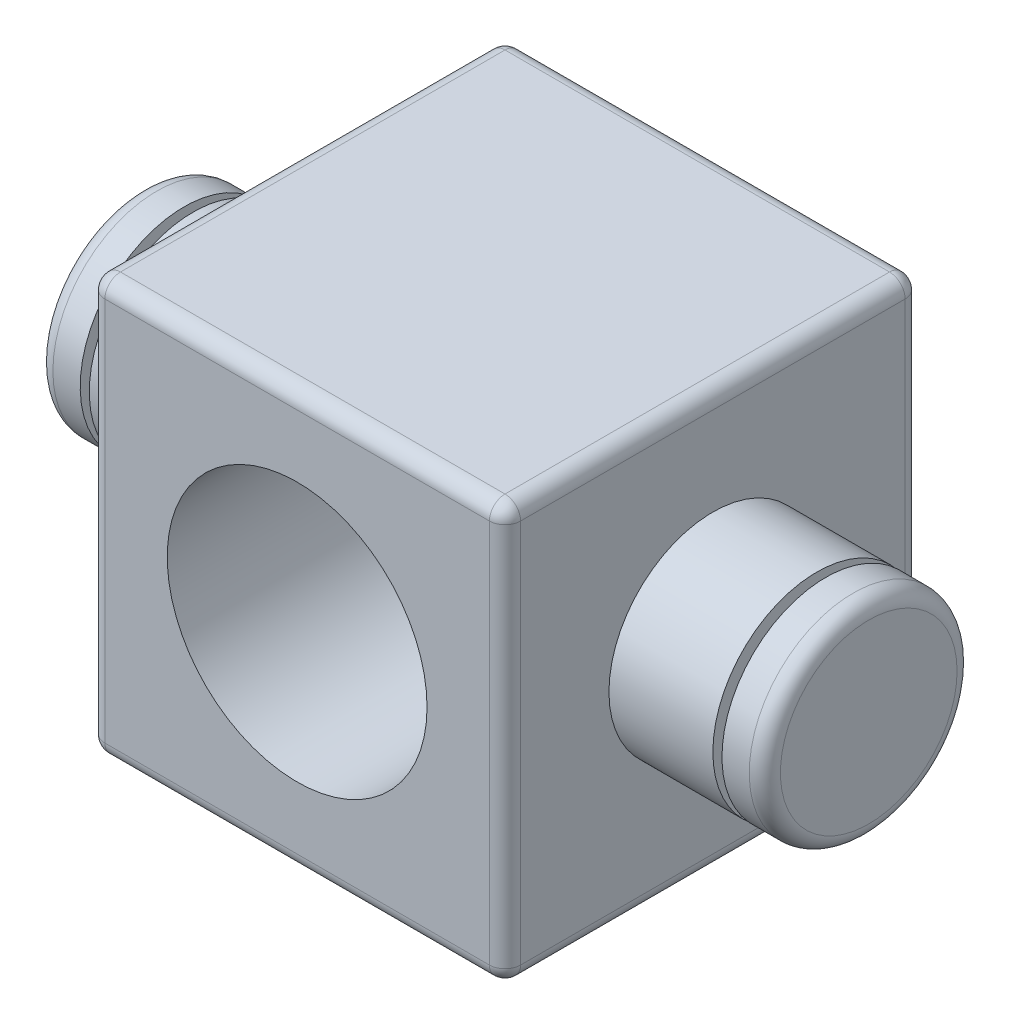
ISO-10303-21;
HEADER;
FILE_DESCRIPTION(('STEP AP214'),'2;1');
FILE_NAME('part.step','',(''),(''),'','','');
FILE_SCHEMA(('AUTOMOTIVE_DESIGN { 1 0 10303 214 1 1 1 1 }'));
ENDSEC;
DATA;
#1=APPLICATION_CONTEXT('core data for automotive mechanical design processes');
#2=APPLICATION_PROTOCOL_DEFINITION('international standard','automotive_design',2000,#1);
#3=PRODUCT_CONTEXT('',#1,'mechanical');
#4=PRODUCT('Part','Part','',(#3));
#5=PRODUCT_RELATED_PRODUCT_CATEGORY('part','',(#4));
#6=PRODUCT_DEFINITION_FORMATION('','',#4);
#7=PRODUCT_DEFINITION_CONTEXT('part definition',#1,'design');
#8=PRODUCT_DEFINITION('design','',#6,#7);
#9=PRODUCT_DEFINITION_SHAPE('','',#8);
#10=(LENGTH_UNIT() NAMED_UNIT(*) SI_UNIT(.MILLI.,.METRE.));
#11=(NAMED_UNIT(*) PLANE_ANGLE_UNIT() SI_UNIT($,.RADIAN.));
#12=(NAMED_UNIT(*) SI_UNIT($,.STERADIAN.) SOLID_ANGLE_UNIT());
#13=UNCERTAINTY_MEASURE_WITH_UNIT(LENGTH_MEASURE(1.E-05),#10,'distance_accuracy_value','');
#14=(GEOMETRIC_REPRESENTATION_CONTEXT(3) GLOBAL_UNCERTAINTY_ASSIGNED_CONTEXT((#13)) GLOBAL_UNIT_ASSIGNED_CONTEXT((#10,
#11,#12)) REPRESENTATION_CONTEXT('',''));
#15=CARTESIAN_POINT('',(0.,0.,0.));
#16=DIRECTION('',(0.,0.,1.));
#17=DIRECTION('',(1.,0.,0.));
#18=AXIS2_PLACEMENT_3D('',#15,#16,#17);
#19=CARTESIAN_POINT('',(110.,40.,40.));
#20=DIRECTION('',(-1.,0.,0.));
#21=DIRECTION('',(0.,0.,1.));
#22=AXIS2_PLACEMENT_3D('',#19,#20,#21);
#23=CYLINDRICAL_SURFACE('',#22,20.);
#24=CARTESIAN_POINT('',(80.,40.,40.));
#25=DIRECTION('',(-1.,0.,0.));
#26=DIRECTION('',(0.,0.,1.));
#27=AXIS2_PLACEMENT_3D('',#24,#25,#26);
#28=CIRCLE('',#27,20.);
#29=CARTESIAN_POINT('',(80.,40.,60.));
#30=VERTEX_POINT('',#29);
#31=EDGE_CURVE('E277',#30,#30,#28,.F.);
#32=ORIENTED_EDGE('',*,*,#31,.T.);
#33=EDGE_LOOP('',(#32));
#34=FACE_BOUND('',#33,.T.);
#35=CARTESIAN_POINT('',(100.,40.,40.));
#36=DIRECTION('',(-1.,0.,0.));
#37=DIRECTION('',(0.,-1.,0.));
#38=AXIS2_PLACEMENT_3D('',#35,#36,#37);
#39=CIRCLE('',#38,20.);
#40=CARTESIAN_POINT('',(100.,20.,40.));
#41=VERTEX_POINT('',#40);
#42=EDGE_CURVE('E343',#41,#41,#39,.T.);
#43=ORIENTED_EDGE('',*,*,#42,.T.);
#44=EDGE_LOOP('',(#43));
#45=FACE_BOUND('',#44,.T.);
#46=ADVANCED_FACE('F34',(#34,#45),#23,.T.);
#47=CARTESIAN_POINT('',(-30.,40.,40.));
#48=DIRECTION('',(1.,0.,0.));
#49=DIRECTION('',(0.,0.,-1.));
#50=AXIS2_PLACEMENT_3D('',#47,#48,#49);
#51=CYLINDRICAL_SURFACE('',#50,20.);
#52=CARTESIAN_POINT('',(0.,40.,40.));
#53=DIRECTION('',(1.,0.,0.));
#54=DIRECTION('',(0.,0.,-1.));
#55=AXIS2_PLACEMENT_3D('',#52,#53,#54);
#56=CIRCLE('',#55,20.);
#57=CARTESIAN_POINT('',(0.,40.,20.));
#58=VERTEX_POINT('',#57);
#59=EDGE_CURVE('E283',#58,#58,#56,.F.);
#60=ORIENTED_EDGE('',*,*,#59,.T.);
#61=EDGE_LOOP('',(#60));
#62=FACE_BOUND('',#61,.T.);
#63=CARTESIAN_POINT('',(-20.,40.,40.));
#64=DIRECTION('',(-1.,0.,0.));
#65=DIRECTION('',(0.,-1.,0.));
#66=AXIS2_PLACEMENT_3D('',#63,#64,#65);
#67=CIRCLE('',#66,20.);
#68=CARTESIAN_POINT('',(-20.,20.,40.));
#69=VERTEX_POINT('',#68);
#70=EDGE_CURVE('E356',#69,#69,#67,.T.);
#71=ORIENTED_EDGE('',*,*,#70,.F.);
#72=EDGE_LOOP('',(#71));
#73=FACE_BOUND('',#72,.T.);
#74=ADVANCED_FACE('F315',(#62,#73),#51,.T.);
#75=CARTESIAN_POINT('',(0.,0.,80.));
#76=DIRECTION('',(0.,0.,-1.));
#77=DIRECTION('',(-1.,0.,0.));
#78=AXIS2_PLACEMENT_3D('',#75,#76,#77);
#79=PLANE('',#78);
#80=DIRECTION('',(0.,-1.,0.));
#81=VECTOR('',#80,1.);
#82=CARTESIAN_POINT('',(3.,0.,80.));
#83=LINE('',#82,#81);
#84=CARTESIAN_POINT('',(3.,77.,80.));
#85=VERTEX_POINT('',#84);
#86=CARTESIAN_POINT('',(3.,3.,80.));
#87=VERTEX_POINT('',#86);
#88=EDGE_CURVE('E191',#85,#87,#83,.T.);
#89=ORIENTED_EDGE('',*,*,#88,.T.);
#90=DIRECTION('',(1.,0.,0.));
#91=VECTOR('',#90,1.);
#92=CARTESIAN_POINT('',(0.,3.,80.));
#93=LINE('',#92,#91);
#94=CARTESIAN_POINT('',(77.,3.,80.));
#95=VERTEX_POINT('',#94);
#96=EDGE_CURVE('E193',#87,#95,#93,.T.);
#97=ORIENTED_EDGE('',*,*,#96,.T.);
#98=DIRECTION('',(0.,1.,0.));
#99=VECTOR('',#98,1.);
#100=CARTESIAN_POINT('',(77.,0.,80.));
#101=LINE('',#100,#99);
#102=CARTESIAN_POINT('',(77.,77.,80.));
#103=VERTEX_POINT('',#102);
#104=EDGE_CURVE('E187',#95,#103,#101,.T.);
#105=ORIENTED_EDGE('',*,*,#104,.T.);
#106=DIRECTION('',(-1.,0.,0.));
#107=VECTOR('',#106,1.);
#108=CARTESIAN_POINT('',(0.,77.,80.));
#109=LINE('',#108,#107);
#110=EDGE_CURVE('E189',#103,#85,#109,.T.);
#111=ORIENTED_EDGE('',*,*,#110,.T.);
#112=EDGE_LOOP('',(#89,#97,#105,#111));
#113=FACE_BOUND('',#112,.T.);
#114=CARTESIAN_POINT('',(40.,40.,80.));
#115=DIRECTION('',(0.,0.,1.));
#116=DIRECTION('',(1.,0.,0.));
#117=AXIS2_PLACEMENT_3D('',#114,#115,#116);
#118=CIRCLE('',#117,25.);
#119=CARTESIAN_POINT('',(65.,40.,80.));
#120=VERTEX_POINT('',#119);
#121=EDGE_CURVE('E272',#120,#120,#118,.T.);
#122=ORIENTED_EDGE('',*,*,#121,.F.);
#123=EDGE_LOOP('',(#122));
#124=FACE_BOUND('',#123,.T.);
#125=ADVANCED_FACE('F323',(#113,#124),#79,.F.);
#126=CARTESIAN_POINT('',(0.,0.,0.));
#127=DIRECTION('',(0.,0.,-1.));
#128=DIRECTION('',(-1.,0.,0.));
#129=AXIS2_PLACEMENT_3D('',#126,#127,#128);
#130=PLANE('',#129);
#131=DIRECTION('',(1.,0.,0.));
#132=VECTOR('',#131,1.);
#133=CARTESIAN_POINT('',(0.,3.,0.));
#134=LINE('',#133,#132);
#135=CARTESIAN_POINT('',(77.,3.,0.));
#136=VERTEX_POINT('',#135);
#137=CARTESIAN_POINT('',(3.,3.,0.));
#138=VERTEX_POINT('',#137);
#139=EDGE_CURVE('E43',#136,#138,#134,.F.);
#140=ORIENTED_EDGE('',*,*,#139,.T.);
#141=DIRECTION('',(0.,-1.,0.));
#142=VECTOR('',#141,1.);
#143=CARTESIAN_POINT('',(3.,80.,0.));
#144=LINE('',#143,#142);
#145=CARTESIAN_POINT('',(3.,77.,0.));
#146=VERTEX_POINT('',#145);
#147=EDGE_CURVE('E11',#138,#146,#144,.F.);
#148=ORIENTED_EDGE('',*,*,#147,.T.);
#149=DIRECTION('',(-1.,0.,0.));
#150=VECTOR('',#149,1.);
#151=CARTESIAN_POINT('',(80.,77.,0.));
#152=LINE('',#151,#150);
#153=CARTESIAN_POINT('',(77.,77.,0.));
#154=VERTEX_POINT('',#153);
#155=EDGE_CURVE('E205',#146,#154,#152,.F.);
#156=ORIENTED_EDGE('',*,*,#155,.T.);
#157=DIRECTION('',(0.,1.,0.));
#158=VECTOR('',#157,1.);
#159=CARTESIAN_POINT('',(77.,0.,0.));
#160=LINE('',#159,#158);
#161=EDGE_CURVE('E54',#154,#136,#160,.F.);
#162=ORIENTED_EDGE('',*,*,#161,.T.);
#163=EDGE_LOOP('',(#140,#148,#156,#162));
#164=FACE_BOUND('',#163,.T.);
#165=CARTESIAN_POINT('',(40.,40.,0.));
#166=DIRECTION('',(0.,0.,1.));
#167=DIRECTION('',(1.,0.,0.));
#168=AXIS2_PLACEMENT_3D('',#165,#166,#167);
#169=CIRCLE('',#168,25.);
#170=CARTESIAN_POINT('',(65.,40.,0.));
#171=VERTEX_POINT('',#170);
#172=EDGE_CURVE('E265',#171,#171,#169,.T.);
#173=ORIENTED_EDGE('',*,*,#172,.T.);
#174=EDGE_LOOP('',(#173));
#175=FACE_BOUND('',#174,.T.);
#176=ADVANCED_FACE('F651',(#164,#175),#130,.T.);
#177=CARTESIAN_POINT('',(0.,0.,80.));
#178=DIRECTION('',(1.,0.,0.));
#179=DIRECTION('',(0.,0.,-1.));
#180=AXIS2_PLACEMENT_3D('',#177,#178,#179);
#181=PLANE('',#180);
#182=DIRECTION('',(0.,0.,-1.));
#183=VECTOR('',#182,1.);
#184=CARTESIAN_POINT('',(0.,3.,80.));
#185=LINE('',#184,#183);
#186=CARTESIAN_POINT('',(0.,3.,3.));
#187=VERTEX_POINT('',#186);
#188=CARTESIAN_POINT('',(0.,3.,77.));
#189=VERTEX_POINT('',#188);
#190=EDGE_CURVE('E153',#187,#189,#185,.F.);
#191=ORIENTED_EDGE('',*,*,#190,.T.);
#192=DIRECTION('',(0.,-1.,0.));
#193=VECTOR('',#192,1.);
#194=CARTESIAN_POINT('',(0.,0.,77.));
#195=LINE('',#194,#193);
#196=CARTESIAN_POINT('',(0.,77.,77.));
#197=VERTEX_POINT('',#196);
#198=EDGE_CURVE('E159',#189,#197,#195,.F.);
#199=ORIENTED_EDGE('',*,*,#198,.T.);
#200=DIRECTION('',(0.,0.,-1.));
#201=VECTOR('',#200,1.);
#202=CARTESIAN_POINT('',(0.,77.,80.));
#203=LINE('',#202,#201);
#204=CARTESIAN_POINT('',(0.,77.,3.));
#205=VERTEX_POINT('',#204);
#206=EDGE_CURVE('E128',#197,#205,#203,.T.);
#207=ORIENTED_EDGE('',*,*,#206,.T.);
#208=DIRECTION('',(0.,-1.,0.));
#209=VECTOR('',#208,1.);
#210=CARTESIAN_POINT('',(0.,0.,3.));
#211=LINE('',#210,#209);
#212=EDGE_CURVE('E147',#205,#187,#211,.T.);
#213=ORIENTED_EDGE('',*,*,#212,.T.);
#214=EDGE_LOOP('',(#191,#199,#207,#213));
#215=FACE_BOUND('',#214,.T.);
#216=ORIENTED_EDGE('',*,*,#59,.F.);
#217=EDGE_LOOP('',(#216));
#218=FACE_BOUND('',#217,.T.);
#219=ADVANCED_FACE('F156',(#215,#218),#181,.F.);
#220=CARTESIAN_POINT('',(0.,0.,80.));
#221=DIRECTION('',(0.,1.,0.));
#222=DIRECTION('',(0.,0.,1.));
#223=AXIS2_PLACEMENT_3D('',#220,#221,#222);
#224=PLANE('',#223);
#225=DIRECTION('',(1.,0.,0.));
#226=VECTOR('',#225,1.);
#227=CARTESIAN_POINT('',(0.,0.,77.));
#228=LINE('',#227,#226);
#229=CARTESIAN_POINT('',(77.,0.,77.));
#230=VERTEX_POINT('',#229);
#231=CARTESIAN_POINT('',(3.,0.,77.));
#232=VERTEX_POINT('',#231);
#233=EDGE_CURVE('E182',#230,#232,#228,.F.);
#234=ORIENTED_EDGE('',*,*,#233,.T.);
#235=DIRECTION('',(0.,0.,-1.));
#236=VECTOR('',#235,1.);
#237=CARTESIAN_POINT('',(3.,0.,80.));
#238=LINE('',#237,#236);
#239=CARTESIAN_POINT('',(3.,0.,3.));
#240=VERTEX_POINT('',#239);
#241=EDGE_CURVE('E184',#232,#240,#238,.T.);
#242=ORIENTED_EDGE('',*,*,#241,.T.);
#243=DIRECTION('',(1.,0.,0.));
#244=VECTOR('',#243,1.);
#245=CARTESIAN_POINT('',(80.,0.,3.));
#246=LINE('',#245,#244);
#247=CARTESIAN_POINT('',(77.,0.,3.));
#248=VERTEX_POINT('',#247);
#249=EDGE_CURVE('E178',#240,#248,#246,.T.);
#250=ORIENTED_EDGE('',*,*,#249,.T.);
#251=DIRECTION('',(0.,0.,-1.));
#252=VECTOR('',#251,1.);
#253=CARTESIAN_POINT('',(77.,0.,80.));
#254=LINE('',#253,#252);
#255=EDGE_CURVE('E180',#248,#230,#254,.F.);
#256=ORIENTED_EDGE('',*,*,#255,.T.);
#257=EDGE_LOOP('',(#234,#242,#250,#256));
#258=FACE_BOUND('',#257,.T.);
#259=ADVANCED_FACE('F632',(#258),#224,.F.);
#260=CARTESIAN_POINT('',(80.,0.,80.));
#261=DIRECTION('',(-1.,0.,0.));
#262=DIRECTION('',(0.,0.,1.));
#263=AXIS2_PLACEMENT_3D('',#260,#261,#262);
#264=PLANE('',#263);
#265=DIRECTION('',(0.,0.,-1.));
#266=VECTOR('',#265,1.);
#267=CARTESIAN_POINT('',(80.,77.,80.));
#268=LINE('',#267,#266);
#269=CARTESIAN_POINT('',(80.,77.,3.));
#270=VERTEX_POINT('',#269);
#271=CARTESIAN_POINT('',(80.,77.,77.));
#272=VERTEX_POINT('',#271);
#273=EDGE_CURVE('E196',#270,#272,#268,.F.);
#274=ORIENTED_EDGE('',*,*,#273,.T.);
#275=DIRECTION('',(0.,1.,0.));
#276=VECTOR('',#275,1.);
#277=CARTESIAN_POINT('',(80.,0.,77.));
#278=LINE('',#277,#276);
#279=CARTESIAN_POINT('',(80.,3.,77.));
#280=VERTEX_POINT('',#279);
#281=EDGE_CURVE('E202',#272,#280,#278,.F.);
#282=ORIENTED_EDGE('',*,*,#281,.T.);
#283=DIRECTION('',(0.,0.,-1.));
#284=VECTOR('',#283,1.);
#285=CARTESIAN_POINT('',(80.,3.,80.));
#286=LINE('',#285,#284);
#287=CARTESIAN_POINT('',(80.,3.,3.));
#288=VERTEX_POINT('',#287);
#289=EDGE_CURVE('E200',#280,#288,#286,.T.);
#290=ORIENTED_EDGE('',*,*,#289,.T.);
#291=DIRECTION('',(0.,1.,0.));
#292=VECTOR('',#291,1.);
#293=CARTESIAN_POINT('',(80.,80.,3.));
#294=LINE('',#293,#292);
#295=EDGE_CURVE('E198',#288,#270,#294,.T.);
#296=ORIENTED_EDGE('',*,*,#295,.T.);
#297=EDGE_LOOP('',(#274,#282,#290,#296));
#298=FACE_BOUND('',#297,.T.);
#299=ORIENTED_EDGE('',*,*,#31,.F.);
#300=EDGE_LOOP('',(#299));
#301=FACE_BOUND('',#300,.T.);
#302=ADVANCED_FACE('F622',(#298,#301),#264,.F.);
#303=CARTESIAN_POINT('',(0.,80.,80.));
#304=DIRECTION('',(0.,-1.,0.));
#305=DIRECTION('',(0.,0.,-1.));
#306=AXIS2_PLACEMENT_3D('',#303,#304,#305);
#307=PLANE('',#306);
#308=DIRECTION('',(-1.,0.,0.));
#309=VECTOR('',#308,1.);
#310=CARTESIAN_POINT('',(0.,80.,3.));
#311=LINE('',#310,#309);
#312=CARTESIAN_POINT('',(77.,80.,3.));
#313=VERTEX_POINT('',#312);
#314=CARTESIAN_POINT('',(3.,80.,3.));
#315=VERTEX_POINT('',#314);
#316=EDGE_CURVE('E162',#313,#315,#311,.T.);
#317=ORIENTED_EDGE('',*,*,#316,.T.);
#318=DIRECTION('',(0.,0.,-1.));
#319=VECTOR('',#318,1.);
#320=CARTESIAN_POINT('',(3.,80.,80.));
#321=LINE('',#320,#319);
#322=CARTESIAN_POINT('',(3.,80.,77.));
#323=VERTEX_POINT('',#322);
#324=EDGE_CURVE('E130',#315,#323,#321,.F.);
#325=ORIENTED_EDGE('',*,*,#324,.T.);
#326=DIRECTION('',(-1.,0.,0.));
#327=VECTOR('',#326,1.);
#328=CARTESIAN_POINT('',(0.,80.,77.));
#329=LINE('',#328,#327);
#330=CARTESIAN_POINT('',(77.,80.,77.));
#331=VERTEX_POINT('',#330);
#332=EDGE_CURVE('E169',#323,#331,#329,.F.);
#333=ORIENTED_EDGE('',*,*,#332,.T.);
#334=DIRECTION('',(0.,0.,-1.));
#335=VECTOR('',#334,1.);
#336=CARTESIAN_POINT('',(77.,80.,80.));
#337=LINE('',#336,#335);
#338=EDGE_CURVE('E167',#331,#313,#337,.T.);
#339=ORIENTED_EDGE('',*,*,#338,.T.);
#340=EDGE_LOOP('',(#317,#325,#333,#339));
#341=FACE_BOUND('',#340,.T.);
#342=ADVANCED_FACE('F617',(#341),#307,.F.);
#343=CARTESIAN_POINT('',(40.,40.,80.));
#344=DIRECTION('',(0.,0.,-1.));
#345=DIRECTION('',(-1.,0.,0.));
#346=AXIS2_PLACEMENT_3D('',#343,#344,#345);
#347=CYLINDRICAL_SURFACE('',#346,25.);
#348=ORIENTED_EDGE('',*,*,#121,.T.);
#349=EDGE_LOOP('',(#348));
#350=FACE_BOUND('',#349,.T.);
#351=ORIENTED_EDGE('',*,*,#172,.F.);
#352=EDGE_LOOP('',(#351));
#353=FACE_BOUND('',#352,.T.);
#354=ADVANCED_FACE('F597',(#350,#353),#347,.F.);
#355=CARTESIAN_POINT('',(77.,3.,80.));
#356=DIRECTION('',(0.,0.,-1.));
#357=DIRECTION('',(-1.,0.,0.));
#358=AXIS2_PLACEMENT_3D('',#355,#356,#357);
#359=CYLINDRICAL_SURFACE('',#358,3.);
#360=CARTESIAN_POINT('',(77.,3.,77.));
#361=DIRECTION('',(0.,0.,1.));
#362=DIRECTION('',(1.,0.,0.));
#363=AXIS2_PLACEMENT_3D('',#360,#361,#362);
#364=CIRCLE('',#363,3.);
#365=EDGE_CURVE('E38',#230,#280,#364,.T.);
#366=ORIENTED_EDGE('',*,*,#365,.F.);
#367=ORIENTED_EDGE('',*,*,#255,.F.);
#368=CARTESIAN_POINT('',(77.,3.,3.));
#369=DIRECTION('',(0.,0.,-1.));
#370=DIRECTION('',(-1.,0.,0.));
#371=AXIS2_PLACEMENT_3D('',#368,#369,#370);
#372=CIRCLE('',#371,3.);
#373=EDGE_CURVE('E258',#288,#248,#372,.T.);
#374=ORIENTED_EDGE('',*,*,#373,.F.);
#375=ORIENTED_EDGE('',*,*,#289,.F.);
#376=EDGE_LOOP('',(#366,#367,#374,#375));
#377=FACE_BOUND('',#376,.T.);
#378=ADVANCED_FACE('F591',(#377),#359,.T.);
#379=CARTESIAN_POINT('',(77.,3.,77.));
#380=DIRECTION('',(0.,0.,1.));
#381=DIRECTION('',(1.,0.,0.));
#382=AXIS2_PLACEMENT_3D('',#379,#380,#381);
#383=SPHERICAL_SURFACE('',#382,3.);
#384=CARTESIAN_POINT('',(77.,3.,77.));
#385=DIRECTION('',(1.,0.,0.));
#386=DIRECTION('',(0.,0.,-1.));
#387=AXIS2_PLACEMENT_3D('',#384,#385,#386);
#388=CIRCLE('',#387,3.);
#389=EDGE_CURVE('E254',#230,#95,#388,.F.);
#390=ORIENTED_EDGE('',*,*,#389,.F.);
#391=ORIENTED_EDGE('',*,*,#365,.T.);
#392=CARTESIAN_POINT('',(77.,3.,77.));
#393=DIRECTION('',(0.,-1.,0.));
#394=DIRECTION('',(0.,0.,-1.));
#395=AXIS2_PLACEMENT_3D('',#392,#393,#394);
#396=CIRCLE('',#395,3.);
#397=EDGE_CURVE('E257',#95,#280,#396,.F.);
#398=ORIENTED_EDGE('',*,*,#397,.F.);
#399=EDGE_LOOP('',(#390,#391,#398));
#400=FACE_BOUND('',#399,.T.);
#401=ADVANCED_FACE('F584',(#400),#383,.T.);
#402=CARTESIAN_POINT('',(77.,3.,3.));
#403=DIRECTION('',(0.,0.,1.));
#404=DIRECTION('',(1.,0.,0.));
#405=AXIS2_PLACEMENT_3D('',#402,#403,#404);
#406=SPHERICAL_SURFACE('',#405,3.);
#407=CARTESIAN_POINT('',(77.,3.,3.));
#408=DIRECTION('',(0.,-1.,0.));
#409=DIRECTION('',(0.,0.,-1.));
#410=AXIS2_PLACEMENT_3D('',#407,#408,#409);
#411=CIRCLE('',#410,3.);
#412=EDGE_CURVE('E249',#288,#136,#411,.F.);
#413=ORIENTED_EDGE('',*,*,#412,.F.);
#414=ORIENTED_EDGE('',*,*,#373,.T.);
#415=CARTESIAN_POINT('',(77.,3.,3.));
#416=DIRECTION('',(1.,0.,0.));
#417=DIRECTION('',(0.,0.,-1.));
#418=AXIS2_PLACEMENT_3D('',#415,#416,#417);
#419=CIRCLE('',#418,3.);
#420=EDGE_CURVE('E251',#136,#248,#419,.F.);
#421=ORIENTED_EDGE('',*,*,#420,.F.);
#422=EDGE_LOOP('',(#413,#414,#421));
#423=FACE_BOUND('',#422,.T.);
#424=ADVANCED_FACE('F576',(#423),#406,.T.);
#425=CARTESIAN_POINT('',(77.,0.,77.));
#426=DIRECTION('',(0.,1.,0.));
#427=DIRECTION('',(0.,0.,1.));
#428=AXIS2_PLACEMENT_3D('',#425,#426,#427);
#429=CYLINDRICAL_SURFACE('',#428,3.);
#430=ORIENTED_EDGE('',*,*,#397,.T.);
#431=ORIENTED_EDGE('',*,*,#281,.F.);
#432=CARTESIAN_POINT('',(77.,77.,77.));
#433=DIRECTION('',(0.,1.,0.));
#434=DIRECTION('',(0.,0.,1.));
#435=AXIS2_PLACEMENT_3D('',#432,#433,#434);
#436=CIRCLE('',#435,3.);
#437=EDGE_CURVE('E243',#103,#272,#436,.T.);
#438=ORIENTED_EDGE('',*,*,#437,.F.);
#439=ORIENTED_EDGE('',*,*,#104,.F.);
#440=EDGE_LOOP('',(#430,#431,#438,#439));
#441=FACE_BOUND('',#440,.T.);
#442=ADVANCED_FACE('F568',(#441),#429,.T.);
#443=CARTESIAN_POINT('',(0.,3.,77.));
#444=DIRECTION('',(1.,0.,0.));
#445=DIRECTION('',(0.,0.,-1.));
#446=AXIS2_PLACEMENT_3D('',#443,#444,#445);
#447=CYLINDRICAL_SURFACE('',#446,3.);
#448=ORIENTED_EDGE('',*,*,#389,.T.);
#449=ORIENTED_EDGE('',*,*,#96,.F.);
#450=CARTESIAN_POINT('',(3.,3.,77.));
#451=DIRECTION('',(-1.,0.,0.));
#452=DIRECTION('',(0.,0.,1.));
#453=AXIS2_PLACEMENT_3D('',#450,#451,#452);
#454=CIRCLE('',#453,3.);
#455=EDGE_CURVE('E240',#232,#87,#454,.T.);
#456=ORIENTED_EDGE('',*,*,#455,.F.);
#457=ORIENTED_EDGE('',*,*,#233,.F.);
#458=EDGE_LOOP('',(#448,#449,#456,#457));
#459=FACE_BOUND('',#458,.T.);
#460=ADVANCED_FACE('F560',(#459),#447,.T.);
#461=CARTESIAN_POINT('',(3.,3.,80.));
#462=DIRECTION('',(0.,0.,-1.));
#463=DIRECTION('',(-1.,0.,0.));
#464=AXIS2_PLACEMENT_3D('',#461,#462,#463);
#465=CYLINDRICAL_SURFACE('',#464,3.);
#466=CARTESIAN_POINT('',(3.,3.,3.));
#467=DIRECTION('',(0.,0.,-1.));
#468=DIRECTION('',(-1.,0.,0.));
#469=AXIS2_PLACEMENT_3D('',#466,#467,#468);
#470=CIRCLE('',#469,3.);
#471=EDGE_CURVE('E234',#240,#187,#470,.T.);
#472=ORIENTED_EDGE('',*,*,#471,.F.);
#473=ORIENTED_EDGE('',*,*,#241,.F.);
#474=CARTESIAN_POINT('',(3.,3.,77.));
#475=DIRECTION('',(0.,0.,1.));
#476=DIRECTION('',(1.,0.,0.));
#477=AXIS2_PLACEMENT_3D('',#474,#475,#476);
#478=CIRCLE('',#477,3.);
#479=EDGE_CURVE('E237',#189,#232,#478,.T.);
#480=ORIENTED_EDGE('',*,*,#479,.F.);
#481=ORIENTED_EDGE('',*,*,#190,.F.);
#482=EDGE_LOOP('',(#472,#473,#480,#481));
#483=FACE_BOUND('',#482,.T.);
#484=ADVANCED_FACE('F552',(#483),#465,.T.);
#485=CARTESIAN_POINT('',(0.,3.,3.));
#486=DIRECTION('',(-1.,0.,0.));
#487=DIRECTION('',(0.,0.,1.));
#488=AXIS2_PLACEMENT_3D('',#485,#486,#487);
#489=CYLINDRICAL_SURFACE('',#488,3.);
#490=ORIENTED_EDGE('',*,*,#420,.T.);
#491=ORIENTED_EDGE('',*,*,#249,.F.);
#492=CARTESIAN_POINT('',(3.,3.,3.));
#493=DIRECTION('',(-1.,0.,0.));
#494=DIRECTION('',(0.,0.,1.));
#495=AXIS2_PLACEMENT_3D('',#492,#493,#494);
#496=CIRCLE('',#495,3.);
#497=EDGE_CURVE('E232',#138,#240,#496,.T.);
#498=ORIENTED_EDGE('',*,*,#497,.F.);
#499=ORIENTED_EDGE('',*,*,#139,.F.);
#500=EDGE_LOOP('',(#490,#491,#498,#499));
#501=FACE_BOUND('',#500,.T.);
#502=ADVANCED_FACE('F544',(#501),#489,.T.);
#503=CARTESIAN_POINT('',(77.,0.,3.));
#504=DIRECTION('',(0.,-1.,0.));
#505=DIRECTION('',(0.,0.,-1.));
#506=AXIS2_PLACEMENT_3D('',#503,#504,#505);
#507=CYLINDRICAL_SURFACE('',#506,3.);
#508=ORIENTED_EDGE('',*,*,#412,.T.);
#509=ORIENTED_EDGE('',*,*,#161,.F.);
#510=CARTESIAN_POINT('',(77.,77.,3.));
#511=DIRECTION('',(0.,1.,0.));
#512=DIRECTION('',(0.,0.,1.));
#513=AXIS2_PLACEMENT_3D('',#510,#511,#512);
#514=CIRCLE('',#513,3.);
#515=EDGE_CURVE('E229',#270,#154,#514,.T.);
#516=ORIENTED_EDGE('',*,*,#515,.F.);
#517=ORIENTED_EDGE('',*,*,#295,.F.);
#518=EDGE_LOOP('',(#508,#509,#516,#517));
#519=FACE_BOUND('',#518,.T.);
#520=ADVANCED_FACE('F536',(#519),#507,.T.);
#521=CARTESIAN_POINT('',(77.,77.,80.));
#522=DIRECTION('',(0.,0.,-1.));
#523=DIRECTION('',(-1.,0.,0.));
#524=AXIS2_PLACEMENT_3D('',#521,#522,#523);
#525=CYLINDRICAL_SURFACE('',#524,3.);
#526=CARTESIAN_POINT('',(77.,77.,77.));
#527=DIRECTION('',(0.,0.,1.));
#528=DIRECTION('',(1.,0.,0.));
#529=AXIS2_PLACEMENT_3D('',#526,#527,#528);
#530=CIRCLE('',#529,3.);
#531=EDGE_CURVE('E246',#272,#331,#530,.T.);
#532=ORIENTED_EDGE('',*,*,#531,.F.);
#533=ORIENTED_EDGE('',*,*,#273,.F.);
#534=CARTESIAN_POINT('',(77.,77.,3.));
#535=DIRECTION('',(0.,0.,-1.));
#536=DIRECTION('',(-1.,0.,0.));
#537=AXIS2_PLACEMENT_3D('',#534,#535,#536);
#538=CIRCLE('',#537,3.);
#539=EDGE_CURVE('E226',#313,#270,#538,.T.);
#540=ORIENTED_EDGE('',*,*,#539,.F.);
#541=ORIENTED_EDGE('',*,*,#338,.F.);
#542=EDGE_LOOP('',(#532,#533,#540,#541));
#543=FACE_BOUND('',#542,.T.);
#544=ADVANCED_FACE('F528',(#543),#525,.T.);
#545=CARTESIAN_POINT('',(77.,77.,77.));
#546=DIRECTION('',(0.,0.,1.));
#547=DIRECTION('',(1.,0.,0.));
#548=AXIS2_PLACEMENT_3D('',#545,#546,#547);
#549=SPHERICAL_SURFACE('',#548,3.);
#550=ORIENTED_EDGE('',*,*,#437,.T.);
#551=ORIENTED_EDGE('',*,*,#531,.T.);
#552=CARTESIAN_POINT('',(77.,77.,77.));
#553=DIRECTION('',(1.,0.,0.));
#554=DIRECTION('',(0.,0.,-1.));
#555=AXIS2_PLACEMENT_3D('',#552,#553,#554);
#556=CIRCLE('',#555,3.);
#557=EDGE_CURVE('E223',#103,#331,#556,.F.);
#558=ORIENTED_EDGE('',*,*,#557,.F.);
#559=EDGE_LOOP('',(#550,#551,#558));
#560=FACE_BOUND('',#559,.T.);
#561=ADVANCED_FACE('F520',(#560),#549,.T.);
#562=CARTESIAN_POINT('',(3.,3.,77.));
#563=DIRECTION('',(0.,0.,1.));
#564=DIRECTION('',(1.,0.,0.));
#565=AXIS2_PLACEMENT_3D('',#562,#563,#564);
#566=SPHERICAL_SURFACE('',#565,3.);
#567=ORIENTED_EDGE('',*,*,#479,.T.);
#568=ORIENTED_EDGE('',*,*,#455,.T.);
#569=CARTESIAN_POINT('',(3.,3.,77.));
#570=DIRECTION('',(0.,-1.,0.));
#571=DIRECTION('',(0.,0.,-1.));
#572=AXIS2_PLACEMENT_3D('',#569,#570,#571);
#573=CIRCLE('',#572,3.);
#574=EDGE_CURVE('E220',#189,#87,#573,.F.);
#575=ORIENTED_EDGE('',*,*,#574,.F.);
#576=EDGE_LOOP('',(#567,#568,#575));
#577=FACE_BOUND('',#576,.T.);
#578=ADVANCED_FACE('F512',(#577),#566,.T.);
#579=CARTESIAN_POINT('',(3.,3.,3.));
#580=DIRECTION('',(0.,0.,1.));
#581=DIRECTION('',(1.,0.,0.));
#582=AXIS2_PLACEMENT_3D('',#579,#580,#581);
#583=SPHERICAL_SURFACE('',#582,3.);
#584=ORIENTED_EDGE('',*,*,#497,.T.);
#585=ORIENTED_EDGE('',*,*,#471,.T.);
#586=CARTESIAN_POINT('',(3.,3.,3.));
#587=DIRECTION('',(0.,-1.,0.));
#588=DIRECTION('',(0.,0.,-1.));
#589=AXIS2_PLACEMENT_3D('',#586,#587,#588);
#590=CIRCLE('',#589,3.);
#591=EDGE_CURVE('E150',#138,#187,#590,.F.);
#592=ORIENTED_EDGE('',*,*,#591,.F.);
#593=EDGE_LOOP('',(#584,#585,#592));
#594=FACE_BOUND('',#593,.T.);
#595=ADVANCED_FACE('F504',(#594),#583,.T.);
#596=CARTESIAN_POINT('',(77.,77.,3.));
#597=DIRECTION('',(0.,0.,1.));
#598=DIRECTION('',(1.,0.,0.));
#599=AXIS2_PLACEMENT_3D('',#596,#597,#598);
#600=SPHERICAL_SURFACE('',#599,3.);
#601=ORIENTED_EDGE('',*,*,#539,.T.);
#602=ORIENTED_EDGE('',*,*,#515,.T.);
#603=CARTESIAN_POINT('',(77.,77.,3.));
#604=DIRECTION('',(1.,0.,0.));
#605=DIRECTION('',(0.,0.,-1.));
#606=AXIS2_PLACEMENT_3D('',#603,#604,#605);
#607=CIRCLE('',#606,3.);
#608=EDGE_CURVE('E216',#313,#154,#607,.F.);
#609=ORIENTED_EDGE('',*,*,#608,.F.);
#610=EDGE_LOOP('',(#601,#602,#609));
#611=FACE_BOUND('',#610,.T.);
#612=ADVANCED_FACE('F496',(#611),#600,.T.);
#613=CARTESIAN_POINT('',(0.,77.,77.));
#614=DIRECTION('',(-1.,0.,0.));
#615=DIRECTION('',(0.,0.,1.));
#616=AXIS2_PLACEMENT_3D('',#613,#614,#615);
#617=CYLINDRICAL_SURFACE('',#616,3.);
#618=ORIENTED_EDGE('',*,*,#557,.T.);
#619=ORIENTED_EDGE('',*,*,#332,.F.);
#620=CARTESIAN_POINT('',(3.,77.,77.));
#621=DIRECTION('',(-1.,0.,0.));
#622=DIRECTION('',(0.,0.,1.));
#623=AXIS2_PLACEMENT_3D('',#620,#621,#622);
#624=CIRCLE('',#623,3.);
#625=EDGE_CURVE('E213',#85,#323,#624,.T.);
#626=ORIENTED_EDGE('',*,*,#625,.F.);
#627=ORIENTED_EDGE('',*,*,#110,.F.);
#628=EDGE_LOOP('',(#618,#619,#626,#627));
#629=FACE_BOUND('',#628,.T.);
#630=ADVANCED_FACE('F488',(#629),#617,.T.);
#631=CARTESIAN_POINT('',(3.,0.,77.));
#632=DIRECTION('',(0.,-1.,0.));
#633=DIRECTION('',(0.,0.,-1.));
#634=AXIS2_PLACEMENT_3D('',#631,#632,#633);
#635=CYLINDRICAL_SURFACE('',#634,3.);
#636=ORIENTED_EDGE('',*,*,#574,.T.);
#637=ORIENTED_EDGE('',*,*,#88,.F.);
#638=CARTESIAN_POINT('',(3.,77.,77.));
#639=DIRECTION('',(0.,1.,0.));
#640=DIRECTION('',(0.,0.,1.));
#641=AXIS2_PLACEMENT_3D('',#638,#639,#640);
#642=CIRCLE('',#641,3.);
#643=EDGE_CURVE('E144',#197,#85,#642,.T.);
#644=ORIENTED_EDGE('',*,*,#643,.F.);
#645=ORIENTED_EDGE('',*,*,#198,.F.);
#646=EDGE_LOOP('',(#636,#637,#644,#645));
#647=FACE_BOUND('',#646,.T.);
#648=ADVANCED_FACE('F481',(#647),#635,.T.);
#649=CARTESIAN_POINT('',(3.,0.,3.));
#650=DIRECTION('',(0.,1.,0.));
#651=DIRECTION('',(0.,0.,1.));
#652=AXIS2_PLACEMENT_3D('',#649,#650,#651);
#653=CYLINDRICAL_SURFACE('',#652,3.);
#654=ORIENTED_EDGE('',*,*,#591,.T.);
#655=ORIENTED_EDGE('',*,*,#212,.F.);
#656=CARTESIAN_POINT('',(3.,77.,3.));
#657=DIRECTION('',(0.,1.,0.));
#658=DIRECTION('',(0.,0.,1.));
#659=AXIS2_PLACEMENT_3D('',#656,#657,#658);
#660=CIRCLE('',#659,3.);
#661=EDGE_CURVE('E136',#146,#205,#660,.T.);
#662=ORIENTED_EDGE('',*,*,#661,.F.);
#663=ORIENTED_EDGE('',*,*,#147,.F.);
#664=EDGE_LOOP('',(#654,#655,#662,#663));
#665=FACE_BOUND('',#664,.T.);
#666=ADVANCED_FACE('F148',(#665),#653,.T.);
#667=CARTESIAN_POINT('',(0.,77.,3.));
#668=DIRECTION('',(1.,0.,0.));
#669=DIRECTION('',(0.,0.,-1.));
#670=AXIS2_PLACEMENT_3D('',#667,#668,#669);
#671=CYLINDRICAL_SURFACE('',#670,3.);
#672=ORIENTED_EDGE('',*,*,#608,.T.);
#673=ORIENTED_EDGE('',*,*,#155,.F.);
#674=CARTESIAN_POINT('',(3.,77.,3.));
#675=DIRECTION('',(-1.,0.,0.));
#676=DIRECTION('',(0.,0.,1.));
#677=AXIS2_PLACEMENT_3D('',#674,#675,#676);
#678=CIRCLE('',#677,3.);
#679=EDGE_CURVE('E140',#315,#146,#678,.T.);
#680=ORIENTED_EDGE('',*,*,#679,.F.);
#681=ORIENTED_EDGE('',*,*,#316,.F.);
#682=EDGE_LOOP('',(#672,#673,#680,#681));
#683=FACE_BOUND('',#682,.T.);
#684=ADVANCED_FACE('F466',(#683),#671,.T.);
#685=CARTESIAN_POINT('',(3.,77.,77.));
#686=DIRECTION('',(0.,0.,1.));
#687=DIRECTION('',(1.,0.,0.));
#688=AXIS2_PLACEMENT_3D('',#685,#686,#687);
#689=SPHERICAL_SURFACE('',#688,3.);
#690=ORIENTED_EDGE('',*,*,#643,.T.);
#691=ORIENTED_EDGE('',*,*,#625,.T.);
#692=CARTESIAN_POINT('',(3.,77.,77.));
#693=DIRECTION('',(0.,0.,1.));
#694=DIRECTION('',(1.,0.,0.));
#695=AXIS2_PLACEMENT_3D('',#692,#693,#694);
#696=CIRCLE('',#695,3.);
#697=EDGE_CURVE('E132',#197,#323,#696,.F.);
#698=ORIENTED_EDGE('',*,*,#697,.F.);
#699=EDGE_LOOP('',(#690,#691,#698));
#700=FACE_BOUND('',#699,.T.);
#701=ADVANCED_FACE('F459',(#700),#689,.T.);
#702=CARTESIAN_POINT('',(3.,77.,3.));
#703=DIRECTION('',(0.,0.,1.));
#704=DIRECTION('',(1.,0.,0.));
#705=AXIS2_PLACEMENT_3D('',#702,#703,#704);
#706=SPHERICAL_SURFACE('',#705,3.);
#707=ORIENTED_EDGE('',*,*,#679,.T.);
#708=ORIENTED_EDGE('',*,*,#661,.T.);
#709=CARTESIAN_POINT('',(3.,77.,3.));
#710=DIRECTION('',(0.,0.,-1.));
#711=DIRECTION('',(-1.,0.,0.));
#712=AXIS2_PLACEMENT_3D('',#709,#710,#711);
#713=CIRCLE('',#712,3.);
#714=EDGE_CURVE('E124',#315,#205,#713,.F.);
#715=ORIENTED_EDGE('',*,*,#714,.F.);
#716=EDGE_LOOP('',(#707,#708,#715));
#717=FACE_BOUND('',#716,.T.);
#718=ADVANCED_FACE('F138',(#717),#706,.T.);
#719=CARTESIAN_POINT('',(3.,77.,80.));
#720=DIRECTION('',(0.,0.,-1.));
#721=DIRECTION('',(-1.,0.,0.));
#722=AXIS2_PLACEMENT_3D('',#719,#720,#721);
#723=CYLINDRICAL_SURFACE('',#722,3.);
#724=ORIENTED_EDGE('',*,*,#697,.T.);
#725=ORIENTED_EDGE('',*,*,#324,.F.);
#726=ORIENTED_EDGE('',*,*,#714,.T.);
#727=ORIENTED_EDGE('',*,*,#206,.F.);
#728=EDGE_LOOP('',(#724,#725,#726,#727));
#729=FACE_BOUND('',#728,.T.);
#730=ADVANCED_FACE('F126',(#729),#723,.T.);
#731=CARTESIAN_POINT('',(-21.75,60.,40.));
#732=DIRECTION('',(1.,0.,0.));
#733=DIRECTION('',(0.,1.,0.));
#734=AXIS2_PLACEMENT_3D('',#731,#732,#733);
#735=PLANE('',#734);
#736=CARTESIAN_POINT('',(-21.75,40.,40.));
#737=DIRECTION('',(-1.,0.,0.));
#738=DIRECTION('',(0.,-1.,0.));
#739=AXIS2_PLACEMENT_3D('',#736,#737,#738);
#740=CIRCLE('',#739,17.5);
#741=CARTESIAN_POINT('',(-21.75,22.5,40.));
#742=VERTEX_POINT('',#741);
#743=EDGE_CURVE('E133',#742,#742,#740,.T.);
#744=ORIENTED_EDGE('',*,*,#743,.T.);
#745=EDGE_LOOP('',(#744));
#746=FACE_BOUND('',#745,.T.);
#747=CARTESIAN_POINT('',(-21.75,40.,40.));
#748=DIRECTION('',(-1.,0.,0.));
#749=DIRECTION('',(0.,-1.,0.));
#750=AXIS2_PLACEMENT_3D('',#747,#748,#749);
#751=CIRCLE('',#750,20.);
#752=CARTESIAN_POINT('',(-21.75,20.,40.));
#753=VERTEX_POINT('',#752);
#754=EDGE_CURVE('E353',#753,#753,#751,.T.);
#755=ORIENTED_EDGE('',*,*,#754,.F.);
#756=EDGE_LOOP('',(#755));
#757=FACE_BOUND('',#756,.T.);
#758=ADVANCED_FACE('F364',(#746,#757),#735,.T.);
#759=CARTESIAN_POINT('',(-30.,40.,40.));
#760=DIRECTION('',(-1.,0.,0.));
#761=DIRECTION('',(0.,-1.,0.));
#762=AXIS2_PLACEMENT_3D('',#759,#760,#761);
#763=CYLINDRICAL_SURFACE('',#762,17.5);
#764=CARTESIAN_POINT('',(-20.,40.,40.));
#765=DIRECTION('',(-1.,0.,0.));
#766=DIRECTION('',(0.,-1.,0.));
#767=AXIS2_PLACEMENT_3D('',#764,#765,#766);
#768=CIRCLE('',#767,17.5);
#769=CARTESIAN_POINT('',(-20.,22.5,40.));
#770=VERTEX_POINT('',#769);
#771=EDGE_CURVE('E359',#770,#770,#768,.T.);
#772=ORIENTED_EDGE('',*,*,#771,.T.);
#773=EDGE_LOOP('',(#772));
#774=FACE_BOUND('',#773,.T.);
#775=ORIENTED_EDGE('',*,*,#743,.F.);
#776=EDGE_LOOP('',(#775));
#777=FACE_BOUND('',#776,.T.);
#778=ADVANCED_FACE('F309',(#774,#777),#763,.T.);
#779=CARTESIAN_POINT('',(-20.,60.,40.));
#780=DIRECTION('',(-1.,0.,0.));
#781=DIRECTION('',(0.,-1.,0.));
#782=AXIS2_PLACEMENT_3D('',#779,#780,#781);
#783=PLANE('',#782);
#784=ORIENTED_EDGE('',*,*,#70,.T.);
#785=EDGE_LOOP('',(#784));
#786=FACE_BOUND('',#785,.T.);
#787=ORIENTED_EDGE('',*,*,#771,.F.);
#788=EDGE_LOOP('',(#787));
#789=FACE_BOUND('',#788,.T.);
#790=ADVANCED_FACE('F303',(#786,#789),#783,.T.);
#791=CARTESIAN_POINT('',(-30.,40.,40.));
#792=DIRECTION('',(-1.,0.,0.));
#793=DIRECTION('',(0.,0.,1.));
#794=AXIS2_PLACEMENT_3D('',#791,#792,#793);
#795=PLANE('',#794);
#796=CARTESIAN_POINT('',(-30.,40.,40.));
#797=DIRECTION('',(-1.,0.,0.));
#798=DIRECTION('',(0.,0.,1.));
#799=AXIS2_PLACEMENT_3D('',#796,#797,#798);
#800=CIRCLE('',#799,17.);
#801=CARTESIAN_POINT('',(-30.,40.,57.));
#802=VERTEX_POINT('',#801);
#803=EDGE_CURVE('E286',#802,#802,#800,.T.);
#804=ORIENTED_EDGE('',*,*,#803,.T.);
#805=EDGE_LOOP('',(#804));
#806=FACE_BOUND('',#805,.T.);
#807=ADVANCED_FACE('F298',(#806),#795,.T.);
#808=CARTESIAN_POINT('',(-27.,40.,40.));
#809=DIRECTION('',(-1.,0.,0.));
#810=DIRECTION('',(0.,0.,1.));
#811=AXIS2_PLACEMENT_3D('',#808,#809,#810);
#812=TOROIDAL_SURFACE('',#811,17.,3.);
#813=CARTESIAN_POINT('',(-27.,40.,40.));
#814=DIRECTION('',(-1.,0.,0.));
#815=DIRECTION('',(0.,0.,1.));
#816=AXIS2_PLACEMENT_3D('',#813,#814,#815);
#817=CIRCLE('',#816,20.);
#818=CARTESIAN_POINT('',(-27.,40.,60.));
#819=VERTEX_POINT('',#818);
#820=EDGE_CURVE('E154',#819,#819,#817,.F.);
#821=ORIENTED_EDGE('',*,*,#820,.F.);
#822=EDGE_LOOP('',(#821));
#823=FACE_BOUND('',#822,.T.);
#824=ORIENTED_EDGE('',*,*,#803,.F.);
#825=EDGE_LOOP('',(#824));
#826=FACE_BOUND('',#825,.T.);
#827=ADVANCED_FACE('F295',(#823,#826),#812,.T.);
#828=ORIENTED_EDGE('',*,*,#820,.T.);
#829=EDGE_LOOP('',(#828));
#830=FACE_BOUND('',#829,.T.);
#831=ORIENTED_EDGE('',*,*,#754,.T.);
#832=EDGE_LOOP('',(#831));
#833=FACE_BOUND('',#832,.T.);
#834=ADVANCED_FACE('F292',(#830,#833),#51,.T.);
#835=CARTESIAN_POINT('',(100.,60.,40.));
#836=DIRECTION('',(1.,0.,0.));
#837=DIRECTION('',(0.,1.,0.));
#838=AXIS2_PLACEMENT_3D('',#835,#836,#837);
#839=PLANE('',#838);
#840=CARTESIAN_POINT('',(100.,40.,40.));
#841=DIRECTION('',(-1.,0.,0.));
#842=DIRECTION('',(0.,-1.,0.));
#843=AXIS2_PLACEMENT_3D('',#840,#841,#842);
#844=CIRCLE('',#843,17.5);
#845=CARTESIAN_POINT('',(100.,22.5,40.));
#846=VERTEX_POINT('',#845);
#847=EDGE_CURVE('E346',#846,#846,#844,.T.);
#848=ORIENTED_EDGE('',*,*,#847,.T.);
#849=EDGE_LOOP('',(#848));
#850=FACE_BOUND('',#849,.T.);
#851=ORIENTED_EDGE('',*,*,#42,.F.);
#852=EDGE_LOOP('',(#851));
#853=FACE_BOUND('',#852,.T.);
#854=ADVANCED_FACE('F374',(#850,#853),#839,.T.);
#855=CARTESIAN_POINT('',(-30.,40.,40.));
#856=DIRECTION('',(-1.,0.,0.));
#857=DIRECTION('',(0.,-1.,0.));
#858=AXIS2_PLACEMENT_3D('',#855,#856,#857);
#859=CYLINDRICAL_SURFACE('',#858,17.5);
#860=CARTESIAN_POINT('',(101.75,40.,40.));
#861=DIRECTION('',(-1.,0.,0.));
#862=DIRECTION('',(0.,-1.,0.));
#863=AXIS2_PLACEMENT_3D('',#860,#861,#862);
#864=CIRCLE('',#863,17.5);
#865=CARTESIAN_POINT('',(101.75,22.5,40.));
#866=VERTEX_POINT('',#865);
#867=EDGE_CURVE('E342',#866,#866,#864,.T.);
#868=ORIENTED_EDGE('',*,*,#867,.T.);
#869=EDGE_LOOP('',(#868));
#870=FACE_BOUND('',#869,.T.);
#871=ORIENTED_EDGE('',*,*,#847,.F.);
#872=EDGE_LOOP('',(#871));
#873=FACE_BOUND('',#872,.T.);
#874=ADVANCED_FACE('F377',(#870,#873),#859,.T.);
#875=CARTESIAN_POINT('',(101.75,60.,40.));
#876=DIRECTION('',(-1.,0.,0.));
#877=DIRECTION('',(0.,-1.,0.));
#878=AXIS2_PLACEMENT_3D('',#875,#876,#877);
#879=PLANE('',#878);
#880=CARTESIAN_POINT('',(101.75,40.,40.));
#881=DIRECTION('',(-1.,0.,0.));
#882=DIRECTION('',(0.,-1.,0.));
#883=AXIS2_PLACEMENT_3D('',#880,#881,#882);
#884=CIRCLE('',#883,20.);
#885=CARTESIAN_POINT('',(101.75,20.,40.));
#886=VERTEX_POINT('',#885);
#887=EDGE_CURVE('E340',#886,#886,#884,.T.);
#888=ORIENTED_EDGE('',*,*,#887,.T.);
#889=EDGE_LOOP('',(#888));
#890=FACE_BOUND('',#889,.T.);
#891=ORIENTED_EDGE('',*,*,#867,.F.);
#892=EDGE_LOOP('',(#891));
#893=FACE_BOUND('',#892,.T.);
#894=ADVANCED_FACE('F381',(#890,#893),#879,.T.);
#895=CARTESIAN_POINT('',(110.,40.,40.));
#896=DIRECTION('',(1.,0.,0.));
#897=DIRECTION('',(0.,0.,-1.));
#898=AXIS2_PLACEMENT_3D('',#895,#896,#897);
#899=PLANE('',#898);
#900=CARTESIAN_POINT('',(110.,40.,40.));
#901=DIRECTION('',(1.,0.,0.));
#902=DIRECTION('',(0.,0.,-1.));
#903=AXIS2_PLACEMENT_3D('',#900,#901,#902);
#904=CIRCLE('',#903,17.);
#905=CARTESIAN_POINT('',(110.,40.,23.));
#906=VERTEX_POINT('',#905);
#907=EDGE_CURVE('E172',#906,#906,#904,.T.);
#908=ORIENTED_EDGE('',*,*,#907,.T.);
#909=EDGE_LOOP('',(#908));
#910=FACE_BOUND('',#909,.T.);
#911=ADVANCED_FACE('F334',(#910),#899,.T.);
#912=CARTESIAN_POINT('',(107.,40.,40.));
#913=DIRECTION('',(1.,0.,0.));
#914=DIRECTION('',(0.,0.,-1.));
#915=AXIS2_PLACEMENT_3D('',#912,#913,#914);
#916=TOROIDAL_SURFACE('',#915,17.,3.);
#917=CARTESIAN_POINT('',(107.,40.,40.));
#918=DIRECTION('',(1.,0.,0.));
#919=DIRECTION('',(0.,0.,-1.));
#920=AXIS2_PLACEMENT_3D('',#917,#918,#919);
#921=CIRCLE('',#920,20.);
#922=CARTESIAN_POINT('',(107.,40.,20.));
#923=VERTEX_POINT('',#922);
#924=EDGE_CURVE('E175',#923,#923,#921,.F.);
#925=ORIENTED_EDGE('',*,*,#924,.F.);
#926=EDGE_LOOP('',(#925));
#927=FACE_BOUND('',#926,.T.);
#928=ORIENTED_EDGE('',*,*,#907,.F.);
#929=EDGE_LOOP('',(#928));
#930=FACE_BOUND('',#929,.T.);
#931=ADVANCED_FACE('F36',(#927,#930),#916,.T.);
#932=ORIENTED_EDGE('',*,*,#924,.T.);
#933=EDGE_LOOP('',(#932));
#934=FACE_BOUND('',#933,.T.);
#935=ORIENTED_EDGE('',*,*,#887,.F.);
#936=EDGE_LOOP('',(#935));
#937=FACE_BOUND('',#936,.T.);
#938=ADVANCED_FACE('F318',(#934,#937),#23,.T.);
#939=CLOSED_SHELL('',(#46,#74,#125,#176,#219,#259,#302,#342,#354,#378,#401,#424,#442,#460,#484,
#502,#520,#544,#561,#578,#595,#612,#630,#648,#666,#684,#701,#718,#730,#758,#778,#790,#807,#827,
#834,#854,#874,#894,#911,#931,#938));
#940=MANIFOLD_SOLID_BREP('B2',#939);
#941=ADVANCED_BREP_SHAPE_REPRESENTATION('',(#18,#940),#14);
#942=SHAPE_DEFINITION_REPRESENTATION(#9,#941);
ENDSEC;
END-ISO-10303-21;
